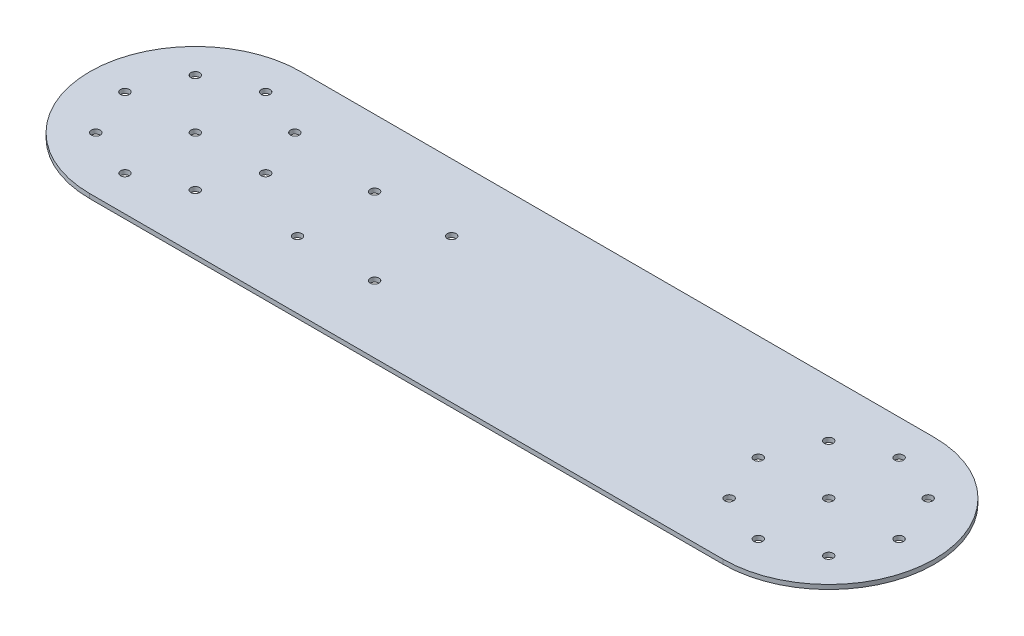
from build123d import *

# Parameters (mm, degrees)
SKETCH1_R               = 3.175
BOSS_EXTRUDE1_DEPTH     = 3.175
SKETCH3_R               = 3.175
CUT_EXTRUDE1_DEPTH      = 315.196690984
CIRPATTERN1_COUNT       = 8
MIRROR1_COPY_1_SKETCH_R = 3.175
MIRROR1_COPY_1_DEPTH    = 315.196690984
MIRROR1_COPY_2_SKETCH_R = 3.175
MIRROR1_COPY_2_DEPTH    = 315.196690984
MIRROR1_COPY_3_SKETCH_R = 3.175
MIRROR1_COPY_3_DEPTH    = 315.196690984
MIRROR1_COPY_4_SKETCH_R = 3.175
MIRROR1_COPY_4_DEPTH    = 315.196690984
MIRROR1_COPY_5_SKETCH_R = 3.175
MIRROR1_COPY_5_DEPTH    = 315.196690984
MIRROR1_COPY_6_SKETCH_R = 3.175
MIRROR1_COPY_6_DEPTH    = 315.196690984
MIRROR1_COPY_7_SKETCH_R = 3.175
MIRROR1_COPY_7_DEPTH    = 315.196690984


with BuildPart() as part:
    # Sketch1 → Boss-Extrude1 (new body)
    with BuildSketch(Plane(origin=(0, 0, 0), x_dir=(1, 0, 0), z_dir=(0, 1, 0))):
        with BuildLine():
            Line((-228.6, -76.2), (228.6, -76.2))
            ThreePointArc((228.6, -76.2), (304.8, 0), (228.6, 76.2))
            Line((228.6, 76.2), (-228.6, 76.2))
            ThreePointArc((-228.6, 76.2), (-304.8, 0), (-228.6, -76.2))
        make_face()
        with Locations(Location((-127, 27.813, 0), (0, 0, 270))):
            Circle(SKETCH1_R, mode=Mode.SUBTRACT)
        with Locations(Location((-127, -27.813, 0), (0, 0, 270))):
            Circle(SKETCH1_R, mode=Mode.SUBTRACT)
        with Locations(Location((-71.374, -27.813, 0), (0, 0, 90))):
            Circle(SKETCH1_R, mode=Mode.SUBTRACT)
        with Locations(Location((-71.374, 27.813, 0), (0, 0, 90))):
            Circle(SKETCH1_R, mode=Mode.SUBTRACT)
    extrude(amount=BOSS_EXTRUDE1_DEPTH)

    # Sketch3 → Cut-Extrude1 (cut, through all)
    with BuildSketch(Plane(origin=(0, 3.175, 0), x_dir=(1, 0, 0), z_dir=(0, 1, 0))):
        with Locations(Location((-228.6, 50.8, 0), (0, 0, 270))):
            Circle(SKETCH3_R)
        with Locations(Location((-228.6, 0, 0), (0, 0, 270))):
            Circle(SKETCH3_R)
    cut_extrude1 = extrude(amount=-CUT_EXTRUDE1_DEPTH, mode=Mode.SUBTRACT)

    # CirPattern1: Cut-Extrude1 ×8 about axis
    cirpattern1_axis = Axis((-228.6, 0, 0), (0, 1, 0))
    for i in range(1, CIRPATTERN1_COUNT):
        add(cut_extrude1.rotate(cirpattern1_axis, i * 360 / CIRPATTERN1_COUNT), mode=Mode.SUBTRACT)

    # Mirror1: Cut-Extrude1 across plane
    add(cut_extrude1.mirror(Plane(origin=(0, 0, 0), x_dir=(0, 0, 1), z_dir=(1, 0, 0))), mode=Mode.SUBTRACT)

    # Mirror1 copy 1 sketch → Mirror1 copy 1 (cut, through all)
    with BuildSketch(Plane(origin=(66.955389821, 3.175, -161.644610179), x_dir=(-0.7071067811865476, 0, -0.7071067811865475), z_dir=(0, 1, 0))):
        with Locations((-228.6, -50.8)):
            Circle(MIRROR1_COPY_1_SKETCH_R)
        with Locations((-228.6, 0)):
            Circle(MIRROR1_COPY_1_SKETCH_R)
    extrude(amount=-MIRROR1_COPY_1_DEPTH, mode=Mode.SUBTRACT)

    # Mirror1 copy 2 sketch → Mirror1 copy 2 (cut, through all)
    with BuildSketch(Plane(origin=(228.6, 3.175, -228.6), x_dir=(0, 0, -1), z_dir=(0, 1, 0))):
        with Locations((-228.6, -50.8)):
            Circle(MIRROR1_COPY_2_SKETCH_R)
        with Locations((-228.6, 0)):
            Circle(MIRROR1_COPY_2_SKETCH_R)
    extrude(amount=-MIRROR1_COPY_2_DEPTH, mode=Mode.SUBTRACT)

    # Mirror1 copy 3 sketch → Mirror1 copy 3 (cut, through all)
    with BuildSketch(Plane(origin=(390.244610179, 3.175, -161.644610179), x_dir=(0.7071067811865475, 0, -0.7071067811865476), z_dir=(0, 1, 0))):
        with Locations((-228.6, -50.8)):
            Circle(MIRROR1_COPY_3_SKETCH_R)
        with Locations((-228.6, 0)):
            Circle(MIRROR1_COPY_3_SKETCH_R)
    extrude(amount=-MIRROR1_COPY_3_DEPTH, mode=Mode.SUBTRACT)

    # Mirror1 copy 4 sketch → Mirror1 copy 4 (cut, through all)
    with BuildSketch(Plane(origin=(457.2, 3.175, 0), x_dir=(1, 0, 0), z_dir=(0, 1, 0))):
        with Locations((-228.6, -50.8)):
            Circle(MIRROR1_COPY_4_SKETCH_R)
        with Locations((-228.6, 0)):
            Circle(MIRROR1_COPY_4_SKETCH_R)
    extrude(amount=-MIRROR1_COPY_4_DEPTH, mode=Mode.SUBTRACT)

    # Mirror1 copy 5 sketch → Mirror1 copy 5 (cut, through all)
    with BuildSketch(Plane(origin=(390.244610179, 3.175, 161.644610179), x_dir=(0.7071067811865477, 0, 0.7071067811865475), z_dir=(0, 1, 0))):
        with Locations((-228.6, -50.8)):
            Circle(MIRROR1_COPY_5_SKETCH_R)
        with Locations((-228.6, 0)):
            Circle(MIRROR1_COPY_5_SKETCH_R)
    extrude(amount=-MIRROR1_COPY_5_DEPTH, mode=Mode.SUBTRACT)

    # Mirror1 copy 6 sketch → Mirror1 copy 6 (cut, through all)
    with BuildSketch(Plane(origin=(228.6, 3.175, 228.6), x_dir=(0, 0, 1), z_dir=(0, 1, 0))):
        with Locations((-228.6, -50.8)):
            Circle(MIRROR1_COPY_6_SKETCH_R)
        with Locations((-228.6, 0)):
            Circle(MIRROR1_COPY_6_SKETCH_R)
    extrude(amount=-MIRROR1_COPY_6_DEPTH, mode=Mode.SUBTRACT)

    # Mirror1 copy 7 sketch → Mirror1 copy 7 (cut, through all)
    with BuildSketch(Plane(origin=(66.955389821, 3.175, 161.644610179), x_dir=(-0.7071067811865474, 0, 0.7071067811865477), z_dir=(0, 1, 0))):
        with Locations((-228.6, -50.8)):
            Circle(MIRROR1_COPY_7_SKETCH_R)
        with Locations((-228.6, 0)):
            Circle(MIRROR1_COPY_7_SKETCH_R)
    extrude(amount=-MIRROR1_COPY_7_DEPTH, mode=Mode.SUBTRACT)


solid = part.part
